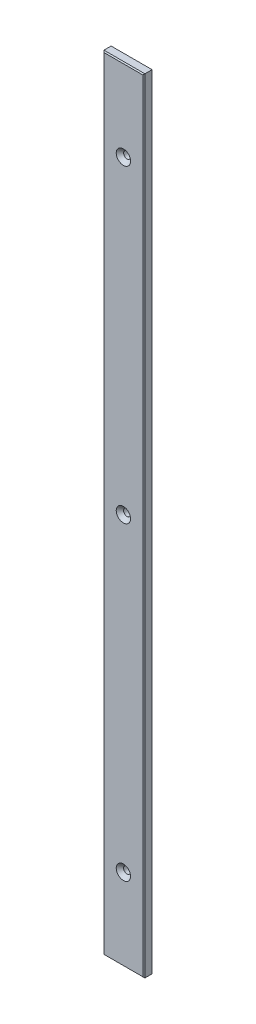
ISO-10303-21;
HEADER;
FILE_DESCRIPTION(('STEP AP214'),'2;1');
FILE_NAME('part.step','',(''),(''),'','','');
FILE_SCHEMA(('AUTOMOTIVE_DESIGN { 1 0 10303 214 1 1 1 1 }'));
ENDSEC;
DATA;
#1=APPLICATION_CONTEXT('core data for automotive mechanical design processes');
#2=APPLICATION_PROTOCOL_DEFINITION('international standard','automotive_design',2000,#1);
#3=PRODUCT_CONTEXT('',#1,'mechanical');
#4=PRODUCT('Part','Part','',(#3));
#5=PRODUCT_RELATED_PRODUCT_CATEGORY('part','',(#4));
#6=PRODUCT_DEFINITION_FORMATION('','',#4);
#7=PRODUCT_DEFINITION_CONTEXT('part definition',#1,'design');
#8=PRODUCT_DEFINITION('design','',#6,#7);
#9=PRODUCT_DEFINITION_SHAPE('','',#8);
#10=(LENGTH_UNIT() NAMED_UNIT(*) SI_UNIT(.MILLI.,.METRE.));
#11=(NAMED_UNIT(*) PLANE_ANGLE_UNIT() SI_UNIT($,.RADIAN.));
#12=(NAMED_UNIT(*) SI_UNIT($,.STERADIAN.) SOLID_ANGLE_UNIT());
#13=UNCERTAINTY_MEASURE_WITH_UNIT(LENGTH_MEASURE(1.E-05),#10,'distance_accuracy_value','');
#14=(GEOMETRIC_REPRESENTATION_CONTEXT(3) GLOBAL_UNCERTAINTY_ASSIGNED_CONTEXT((#13)) GLOBAL_UNIT_ASSIGNED_CONTEXT((#10,
#11,#12)) REPRESENTATION_CONTEXT('',''));
#15=CARTESIAN_POINT('',(0.,0.,0.));
#16=DIRECTION('',(0.,0.,1.));
#17=DIRECTION('',(1.,0.,0.));
#18=AXIS2_PLACEMENT_3D('',#15,#16,#17);
#19=CARTESIAN_POINT('',(10.,-191.25,4.));
#20=DIRECTION('',(-1.,0.,0.));
#21=DIRECTION('',(0.,0.,1.));
#22=AXIS2_PLACEMENT_3D('',#19,#20,#21);
#23=PLANE('',#22);
#24=DIRECTION('',(0.,0.,-1.));
#25=VECTOR('',#24,1.);
#26=CARTESIAN_POINT('',(10.,191.25,4.));
#27=LINE('',#26,#25);
#28=CARTESIAN_POINT('',(10.,191.25,3.49999999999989));
#29=VERTEX_POINT('',#28);
#30=CARTESIAN_POINT('',(10.,191.25,0.));
#31=VERTEX_POINT('',#30);
#32=EDGE_CURVE('E88',#29,#31,#27,.T.);
#33=ORIENTED_EDGE('',*,*,#32,.F.);
#34=DIRECTION('',(0.,-1.,0.));
#35=VECTOR('',#34,1.);
#36=CARTESIAN_POINT('',(10.,-191.25,3.49999999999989));
#37=LINE('',#36,#35);
#38=CARTESIAN_POINT('',(10.,-191.25,3.49999999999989));
#39=VERTEX_POINT('',#38);
#40=EDGE_CURVE('E135',#29,#39,#37,.T.);
#41=ORIENTED_EDGE('',*,*,#40,.T.);
#42=DIRECTION('',(0.,0.,-1.));
#43=VECTOR('',#42,1.);
#44=CARTESIAN_POINT('',(10.,-191.25,4.));
#45=LINE('',#44,#43);
#46=CARTESIAN_POINT('',(10.,-191.25,0.));
#47=VERTEX_POINT('',#46);
#48=EDGE_CURVE('E108',#39,#47,#45,.T.);
#49=ORIENTED_EDGE('',*,*,#48,.T.);
#50=DIRECTION('',(0.,1.,0.));
#51=VECTOR('',#50,1.);
#52=CARTESIAN_POINT('',(10.,-191.25,0.));
#53=LINE('',#52,#51);
#54=EDGE_CURVE('E103',#47,#31,#53,.T.);
#55=ORIENTED_EDGE('',*,*,#54,.T.);
#56=EDGE_LOOP('',(#33,#41,#49,#55));
#57=FACE_BOUND('',#56,.T.);
#58=ADVANCED_FACE('F36',(#57),#23,.F.);
#59=CARTESIAN_POINT('',(-10.,191.25,4.));
#60=DIRECTION('',(0.,-1.,0.));
#61=DIRECTION('',(0.,0.,-1.));
#62=AXIS2_PLACEMENT_3D('',#59,#60,#61);
#63=PLANE('',#62);
#64=DIRECTION('',(0.,0.,-1.));
#65=VECTOR('',#64,1.);
#66=CARTESIAN_POINT('',(-10.,191.25,4.));
#67=LINE('',#66,#65);
#68=CARTESIAN_POINT('',(-10.,191.25,3.49999999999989));
#69=VERTEX_POINT('',#68);
#70=CARTESIAN_POINT('',(-10.,191.25,0.));
#71=VERTEX_POINT('',#70);
#72=EDGE_CURVE('E97',#69,#71,#67,.T.);
#73=ORIENTED_EDGE('',*,*,#72,.F.);
#74=DIRECTION('',(1.,0.,0.));
#75=VECTOR('',#74,1.);
#76=CARTESIAN_POINT('',(-10.,191.25,3.49999999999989));
#77=LINE('',#76,#75);
#78=EDGE_CURVE('E11',#69,#29,#77,.T.);
#79=ORIENTED_EDGE('',*,*,#78,.T.);
#80=ORIENTED_EDGE('',*,*,#32,.T.);
#81=DIRECTION('',(-1.,0.,0.));
#82=VECTOR('',#81,1.);
#83=CARTESIAN_POINT('',(-10.,191.25,0.));
#84=LINE('',#83,#82);
#85=EDGE_CURVE('E91',#31,#71,#84,.T.);
#86=ORIENTED_EDGE('',*,*,#85,.T.);
#87=EDGE_LOOP('',(#73,#79,#80,#86));
#88=FACE_BOUND('',#87,.T.);
#89=ADVANCED_FACE('F90',(#88),#63,.F.);
#90=CARTESIAN_POINT('',(-10.,-191.25,4.));
#91=DIRECTION('',(1.,0.,0.));
#92=DIRECTION('',(0.,0.,-1.));
#93=AXIS2_PLACEMENT_3D('',#90,#91,#92);
#94=PLANE('',#93);
#95=DIRECTION('',(0.,0.,-1.));
#96=VECTOR('',#95,1.);
#97=CARTESIAN_POINT('',(-10.,-191.25,4.));
#98=LINE('',#97,#96);
#99=CARTESIAN_POINT('',(-10.,-191.25,3.49999999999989));
#100=VERTEX_POINT('',#99);
#101=CARTESIAN_POINT('',(-10.,-191.25,0.));
#102=VERTEX_POINT('',#101);
#103=EDGE_CURVE('E121',#100,#102,#98,.T.);
#104=ORIENTED_EDGE('',*,*,#103,.F.);
#105=DIRECTION('',(0.,1.,0.));
#106=VECTOR('',#105,1.);
#107=CARTESIAN_POINT('',(-10.,-191.25,3.49999999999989));
#108=LINE('',#107,#106);
#109=EDGE_CURVE('E46',#100,#69,#108,.T.);
#110=ORIENTED_EDGE('',*,*,#109,.T.);
#111=ORIENTED_EDGE('',*,*,#72,.T.);
#112=DIRECTION('',(0.,-1.,0.));
#113=VECTOR('',#112,1.);
#114=CARTESIAN_POINT('',(-10.,-191.25,0.));
#115=LINE('',#114,#113);
#116=EDGE_CURVE('E105',#71,#102,#115,.T.);
#117=ORIENTED_EDGE('',*,*,#116,.T.);
#118=EDGE_LOOP('',(#104,#110,#111,#117));
#119=FACE_BOUND('',#118,.T.);
#120=ADVANCED_FACE('F196',(#119),#94,.F.);
#121=CARTESIAN_POINT('',(-10.,-191.25,4.));
#122=DIRECTION('',(0.,1.,0.));
#123=DIRECTION('',(0.,0.,1.));
#124=AXIS2_PLACEMENT_3D('',#121,#122,#123);
#125=PLANE('',#124);
#126=ORIENTED_EDGE('',*,*,#48,.F.);
#127=DIRECTION('',(-1.,0.,0.));
#128=VECTOR('',#127,1.);
#129=CARTESIAN_POINT('',(-10.,-191.25,3.49999999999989));
#130=LINE('',#129,#128);
#131=EDGE_CURVE('E132',#39,#100,#130,.T.);
#132=ORIENTED_EDGE('',*,*,#131,.T.);
#133=ORIENTED_EDGE('',*,*,#103,.T.);
#134=DIRECTION('',(1.,0.,0.));
#135=VECTOR('',#134,1.);
#136=CARTESIAN_POINT('',(-10.,-191.25,0.));
#137=LINE('',#136,#135);
#138=EDGE_CURVE('E118',#102,#47,#137,.T.);
#139=ORIENTED_EDGE('',*,*,#138,.T.);
#140=EDGE_LOOP('',(#126,#132,#133,#139));
#141=FACE_BOUND('',#140,.T.);
#142=ADVANCED_FACE('F187',(#141),#125,.F.);
#143=CARTESIAN_POINT('',(0.,0.,4.));
#144=DIRECTION('',(0.,0.,-1.));
#145=DIRECTION('',(-1.,0.,0.));
#146=AXIS2_PLACEMENT_3D('',#143,#144,#145);
#147=PLANE('',#146);
#148=DIRECTION('',(0.,-1.,0.));
#149=VECTOR('',#148,1.);
#150=CARTESIAN_POINT('',(-9.49999999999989,0.,4.));
#151=LINE('',#150,#149);
#152=CARTESIAN_POINT('',(-9.49999999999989,190.75,4.));
#153=VERTEX_POINT('',#152);
#154=CARTESIAN_POINT('',(-9.49999999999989,-190.75,4.));
#155=VERTEX_POINT('',#154);
#156=EDGE_CURVE('E125',#153,#155,#151,.T.);
#157=ORIENTED_EDGE('',*,*,#156,.T.);
#158=DIRECTION('',(1.,0.,0.));
#159=VECTOR('',#158,1.);
#160=CARTESIAN_POINT('',(0.,-190.75,4.));
#161=LINE('',#160,#159);
#162=CARTESIAN_POINT('',(9.49999999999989,-190.75,4.));
#163=VERTEX_POINT('',#162);
#164=EDGE_CURVE('E129',#155,#163,#161,.T.);
#165=ORIENTED_EDGE('',*,*,#164,.T.);
#166=DIRECTION('',(0.,1.,0.));
#167=VECTOR('',#166,1.);
#168=CARTESIAN_POINT('',(9.49999999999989,0.,4.));
#169=LINE('',#168,#167);
#170=CARTESIAN_POINT('',(9.49999999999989,190.75,4.));
#171=VERTEX_POINT('',#170);
#172=EDGE_CURVE('E127',#163,#171,#169,.T.);
#173=ORIENTED_EDGE('',*,*,#172,.T.);
#174=DIRECTION('',(-1.,0.,0.));
#175=VECTOR('',#174,1.);
#176=CARTESIAN_POINT('',(0.,190.75,4.));
#177=LINE('',#176,#175);
#178=EDGE_CURVE('E96',#171,#153,#177,.T.);
#179=ORIENTED_EDGE('',*,*,#178,.T.);
#180=EDGE_LOOP('',(#157,#165,#173,#179));
#181=FACE_BOUND('',#180,.T.);
#182=CARTESIAN_POINT('',(0.,151.25,4.));
#183=DIRECTION('',(0.,0.,1.));
#184=DIRECTION('',(1.,0.,0.));
#185=AXIS2_PLACEMENT_3D('',#182,#183,#184);
#186=CIRCLE('',#185,3.5);
#187=CARTESIAN_POINT('',(3.5,151.25,4.));
#188=VERTEX_POINT('',#187);
#189=EDGE_CURVE('E147',#188,#188,#186,.T.);
#190=ORIENTED_EDGE('',*,*,#189,.F.);
#191=EDGE_LOOP('',(#190));
#192=FACE_BOUND('',#191,.T.);
#193=CARTESIAN_POINT('',(0.,0.,4.));
#194=DIRECTION('',(0.,0.,1.));
#195=DIRECTION('',(1.,0.,0.));
#196=AXIS2_PLACEMENT_3D('',#193,#194,#195);
#197=CIRCLE('',#196,3.5);
#198=CARTESIAN_POINT('',(3.5,0.,4.));
#199=VERTEX_POINT('',#198);
#200=EDGE_CURVE('E162',#199,#199,#197,.T.);
#201=ORIENTED_EDGE('',*,*,#200,.F.);
#202=EDGE_LOOP('',(#201));
#203=FACE_BOUND('',#202,.T.);
#204=CARTESIAN_POINT('',(0.,-151.25,4.));
#205=DIRECTION('',(0.,0.,1.));
#206=DIRECTION('',(1.,0.,0.));
#207=AXIS2_PLACEMENT_3D('',#204,#205,#206);
#208=CIRCLE('',#207,3.5);
#209=CARTESIAN_POINT('',(3.5,-151.25,4.));
#210=VERTEX_POINT('',#209);
#211=EDGE_CURVE('E171',#210,#210,#208,.T.);
#212=ORIENTED_EDGE('',*,*,#211,.F.);
#213=EDGE_LOOP('',(#212));
#214=FACE_BOUND('',#213,.T.);
#215=ADVANCED_FACE('F185',(#181,#192,#203,#214),#147,.F.);
#216=CARTESIAN_POINT('',(0.,0.,0.));
#217=DIRECTION('',(0.,0.,-1.));
#218=DIRECTION('',(-1.,0.,0.));
#219=AXIS2_PLACEMENT_3D('',#216,#217,#218);
#220=PLANE('',#219);
#221=CARTESIAN_POINT('',(0.,151.25,0.));
#222=DIRECTION('',(0.,0.,1.));
#223=DIRECTION('',(1.,0.,0.));
#224=AXIS2_PLACEMENT_3D('',#221,#222,#223);
#225=CIRCLE('',#224,1.7);
#226=CARTESIAN_POINT('',(1.7,151.25,0.));
#227=VERTEX_POINT('',#226);
#228=EDGE_CURVE('E157',#227,#227,#225,.T.);
#229=ORIENTED_EDGE('',*,*,#228,.T.);
#230=EDGE_LOOP('',(#229));
#231=FACE_BOUND('',#230,.T.);
#232=CARTESIAN_POINT('',(0.,0.,0.));
#233=DIRECTION('',(0.,0.,1.));
#234=DIRECTION('',(1.,0.,0.));
#235=AXIS2_PLACEMENT_3D('',#232,#233,#234);
#236=CIRCLE('',#235,1.7);
#237=CARTESIAN_POINT('',(1.7,0.,0.));
#238=VERTEX_POINT('',#237);
#239=EDGE_CURVE('E168',#238,#238,#236,.T.);
#240=ORIENTED_EDGE('',*,*,#239,.T.);
#241=EDGE_LOOP('',(#240));
#242=FACE_BOUND('',#241,.T.);
#243=CARTESIAN_POINT('',(0.,-151.25,0.));
#244=DIRECTION('',(0.,0.,1.));
#245=DIRECTION('',(1.,0.,0.));
#246=AXIS2_PLACEMENT_3D('',#243,#244,#245);
#247=CIRCLE('',#246,1.7);
#248=CARTESIAN_POINT('',(1.7,-151.25,0.));
#249=VERTEX_POINT('',#248);
#250=EDGE_CURVE('E110',#249,#249,#247,.T.);
#251=ORIENTED_EDGE('',*,*,#250,.T.);
#252=EDGE_LOOP('',(#251));
#253=FACE_BOUND('',#252,.T.);
#254=ORIENTED_EDGE('',*,*,#54,.F.);
#255=ORIENTED_EDGE('',*,*,#138,.F.);
#256=ORIENTED_EDGE('',*,*,#116,.F.);
#257=ORIENTED_EDGE('',*,*,#85,.F.);
#258=EDGE_LOOP('',(#254,#255,#256,#257));
#259=FACE_BOUND('',#258,.T.);
#260=ADVANCED_FACE('F101',(#231,#242,#253,#259),#220,.T.);
#261=CARTESIAN_POINT('',(0.,-151.25,4.));
#262=DIRECTION('',(0.,0.,1.));
#263=DIRECTION('',(1.,0.,0.));
#264=AXIS2_PLACEMENT_3D('',#261,#262,#263);
#265=CYLINDRICAL_SURFACE('',#264,1.7);
#266=ORIENTED_EDGE('',*,*,#250,.F.);
#267=EDGE_LOOP('',(#266));
#268=FACE_BOUND('',#267,.T.);
#269=CARTESIAN_POINT('',(0.,-151.25,2.2));
#270=DIRECTION('',(0.,0.,1.));
#271=DIRECTION('',(1.,0.,0.));
#272=AXIS2_PLACEMENT_3D('',#269,#270,#271);
#273=CIRCLE('',#272,1.7);
#274=CARTESIAN_POINT('',(1.7,-151.25,2.2));
#275=VERTEX_POINT('',#274);
#276=EDGE_CURVE('E113',#275,#275,#273,.T.);
#277=ORIENTED_EDGE('',*,*,#276,.T.);
#278=EDGE_LOOP('',(#277));
#279=FACE_BOUND('',#278,.T.);
#280=ADVANCED_FACE('F176',(#268,#279),#265,.F.);
#281=CARTESIAN_POINT('',(0.,-151.25,4.));
#282=DIRECTION('',(0.,0.,1.));
#283=DIRECTION('',(1.,0.,0.));
#284=AXIS2_PLACEMENT_3D('',#281,#282,#283);
#285=CONICAL_SURFACE('',#284,3.5,0.785398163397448);
#286=ORIENTED_EDGE('',*,*,#276,.F.);
#287=EDGE_LOOP('',(#286));
#288=FACE_BOUND('',#287,.T.);
#289=ORIENTED_EDGE('',*,*,#211,.T.);
#290=EDGE_LOOP('',(#289));
#291=FACE_BOUND('',#290,.T.);
#292=ADVANCED_FACE('F178',(#288,#291),#285,.F.);
#293=CARTESIAN_POINT('',(0.,0.,4.));
#294=DIRECTION('',(0.,0.,1.));
#295=DIRECTION('',(1.,0.,0.));
#296=AXIS2_PLACEMENT_3D('',#293,#294,#295);
#297=CYLINDRICAL_SURFACE('',#296,1.7);
#298=ORIENTED_EDGE('',*,*,#239,.F.);
#299=EDGE_LOOP('',(#298));
#300=FACE_BOUND('',#299,.T.);
#301=CARTESIAN_POINT('',(0.,0.,2.2));
#302=DIRECTION('',(0.,0.,1.));
#303=DIRECTION('',(1.,0.,0.));
#304=AXIS2_PLACEMENT_3D('',#301,#302,#303);
#305=CIRCLE('',#304,1.7);
#306=CARTESIAN_POINT('',(1.7,0.,2.2));
#307=VERTEX_POINT('',#306);
#308=EDGE_CURVE('E165',#307,#307,#305,.T.);
#309=ORIENTED_EDGE('',*,*,#308,.T.);
#310=EDGE_LOOP('',(#309));
#311=FACE_BOUND('',#310,.T.);
#312=ADVANCED_FACE('F181',(#300,#311),#297,.F.);
#313=CARTESIAN_POINT('',(0.,0.,4.));
#314=DIRECTION('',(0.,0.,1.));
#315=DIRECTION('',(1.,0.,0.));
#316=AXIS2_PLACEMENT_3D('',#313,#314,#315);
#317=CONICAL_SURFACE('',#316,3.5,0.785398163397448);
#318=ORIENTED_EDGE('',*,*,#308,.F.);
#319=EDGE_LOOP('',(#318));
#320=FACE_BOUND('',#319,.T.);
#321=ORIENTED_EDGE('',*,*,#200,.T.);
#322=EDGE_LOOP('',(#321));
#323=FACE_BOUND('',#322,.T.);
#324=ADVANCED_FACE('F291',(#320,#323),#317,.F.);
#325=CARTESIAN_POINT('',(0.,151.25,4.));
#326=DIRECTION('',(0.,0.,1.));
#327=DIRECTION('',(1.,0.,0.));
#328=AXIS2_PLACEMENT_3D('',#325,#326,#327);
#329=CYLINDRICAL_SURFACE('',#328,1.7);
#330=ORIENTED_EDGE('',*,*,#228,.F.);
#331=EDGE_LOOP('',(#330));
#332=FACE_BOUND('',#331,.T.);
#333=CARTESIAN_POINT('',(0.,151.25,2.2));
#334=DIRECTION('',(0.,0.,1.));
#335=DIRECTION('',(1.,0.,0.));
#336=AXIS2_PLACEMENT_3D('',#333,#334,#335);
#337=CIRCLE('',#336,1.7);
#338=CARTESIAN_POINT('',(1.7,151.25,2.2));
#339=VERTEX_POINT('',#338);
#340=EDGE_CURVE('E152',#339,#339,#337,.T.);
#341=ORIENTED_EDGE('',*,*,#340,.T.);
#342=EDGE_LOOP('',(#341));
#343=FACE_BOUND('',#342,.T.);
#344=ADVANCED_FACE('F234',(#332,#343),#329,.F.);
#345=CARTESIAN_POINT('',(0.,151.25,4.));
#346=DIRECTION('',(0.,0.,1.));
#347=DIRECTION('',(1.,0.,0.));
#348=AXIS2_PLACEMENT_3D('',#345,#346,#347);
#349=CONICAL_SURFACE('',#348,3.5,0.785398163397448);
#350=ORIENTED_EDGE('',*,*,#340,.F.);
#351=EDGE_LOOP('',(#350));
#352=FACE_BOUND('',#351,.T.);
#353=ORIENTED_EDGE('',*,*,#189,.T.);
#354=EDGE_LOOP('',(#353));
#355=FACE_BOUND('',#354,.T.);
#356=ADVANCED_FACE('F229',(#352,#355),#349,.F.);
#357=CARTESIAN_POINT('',(0.,190.75,4.));
#358=DIRECTION('',(0.,-0.707106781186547,-0.707106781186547));
#359=DIRECTION('',(-1.,0.,0.));
#360=AXIS2_PLACEMENT_3D('',#357,#358,#359);
#361=PLANE('',#360);
#362=DIRECTION('',(0.577350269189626,0.577350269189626,-0.577350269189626));
#363=VECTOR('',#362,1.);
#364=CARTESIAN_POINT('',(6.33333333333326,187.583333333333,7.16666666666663));
#365=LINE('',#364,#363);
#366=EDGE_CURVE('E141',#29,#171,#365,.F.);
#367=ORIENTED_EDGE('',*,*,#366,.F.);
#368=ORIENTED_EDGE('',*,*,#78,.F.);
#369=DIRECTION('',(0.577350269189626,-0.577350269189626,0.577350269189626));
#370=VECTOR('',#369,1.);
#371=CARTESIAN_POINT('',(-6.33333333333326,187.583333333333,7.16666666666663));
#372=LINE('',#371,#370);
#373=EDGE_CURVE('E41',#153,#69,#372,.F.);
#374=ORIENTED_EDGE('',*,*,#373,.F.);
#375=ORIENTED_EDGE('',*,*,#178,.F.);
#376=EDGE_LOOP('',(#367,#368,#374,#375));
#377=FACE_BOUND('',#376,.T.);
#378=ADVANCED_FACE('F39',(#377),#361,.F.);
#379=CARTESIAN_POINT('',(-9.49999999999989,0.,4.));
#380=DIRECTION('',(0.707106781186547,0.,-0.707106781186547));
#381=DIRECTION('',(0.,-1.,0.));
#382=AXIS2_PLACEMENT_3D('',#379,#380,#381);
#383=PLANE('',#382);
#384=ORIENTED_EDGE('',*,*,#373,.T.);
#385=ORIENTED_EDGE('',*,*,#109,.F.);
#386=DIRECTION('',(0.577350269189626,0.577350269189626,0.577350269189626));
#387=VECTOR('',#386,1.);
#388=CARTESIAN_POINT('',(54.0833333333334,-127.166666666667,67.5833333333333));
#389=LINE('',#388,#387);
#390=EDGE_CURVE('E140',#155,#100,#389,.F.);
#391=ORIENTED_EDGE('',*,*,#390,.F.);
#392=ORIENTED_EDGE('',*,*,#156,.F.);
#393=EDGE_LOOP('',(#384,#385,#391,#392));
#394=FACE_BOUND('',#393,.T.);
#395=ADVANCED_FACE('F222',(#394),#383,.F.);
#396=CARTESIAN_POINT('',(9.49999999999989,0.,4.));
#397=DIRECTION('',(-0.707106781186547,0.,-0.707106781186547));
#398=DIRECTION('',(0.,1.,0.));
#399=AXIS2_PLACEMENT_3D('',#396,#397,#398);
#400=PLANE('',#399);
#401=ORIENTED_EDGE('',*,*,#366,.T.);
#402=ORIENTED_EDGE('',*,*,#172,.F.);
#403=DIRECTION('',(0.577350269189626,-0.577350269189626,-0.577350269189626));
#404=VECTOR('',#403,1.);
#405=CARTESIAN_POINT('',(-54.0833333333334,-127.166666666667,67.5833333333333));
#406=LINE('',#405,#404);
#407=EDGE_CURVE('E138',#39,#163,#406,.F.);
#408=ORIENTED_EDGE('',*,*,#407,.F.);
#409=ORIENTED_EDGE('',*,*,#40,.F.);
#410=EDGE_LOOP('',(#401,#402,#408,#409));
#411=FACE_BOUND('',#410,.T.);
#412=ADVANCED_FACE('F216',(#411),#400,.F.);
#413=CARTESIAN_POINT('',(0.,-190.75,4.));
#414=DIRECTION('',(0.,0.707106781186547,-0.707106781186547));
#415=DIRECTION('',(1.,0.,0.));
#416=AXIS2_PLACEMENT_3D('',#413,#414,#415);
#417=PLANE('',#416);
#418=ORIENTED_EDGE('',*,*,#390,.T.);
#419=ORIENTED_EDGE('',*,*,#131,.F.);
#420=ORIENTED_EDGE('',*,*,#407,.T.);
#421=ORIENTED_EDGE('',*,*,#164,.F.);
#422=EDGE_LOOP('',(#418,#419,#420,#421));
#423=FACE_BOUND('',#422,.T.);
#424=ADVANCED_FACE('F210',(#423),#417,.F.);
#425=CLOSED_SHELL('',(#58,#89,#120,#142,#215,#260,#280,#292,#312,#324,#344,#356,#378,#395,#412,#424));
#426=MANIFOLD_SOLID_BREP('B2',#425);
#427=ADVANCED_BREP_SHAPE_REPRESENTATION('',(#18,#426),#14);
#428=SHAPE_DEFINITION_REPRESENTATION(#9,#427);
ENDSEC;
END-ISO-10303-21;
